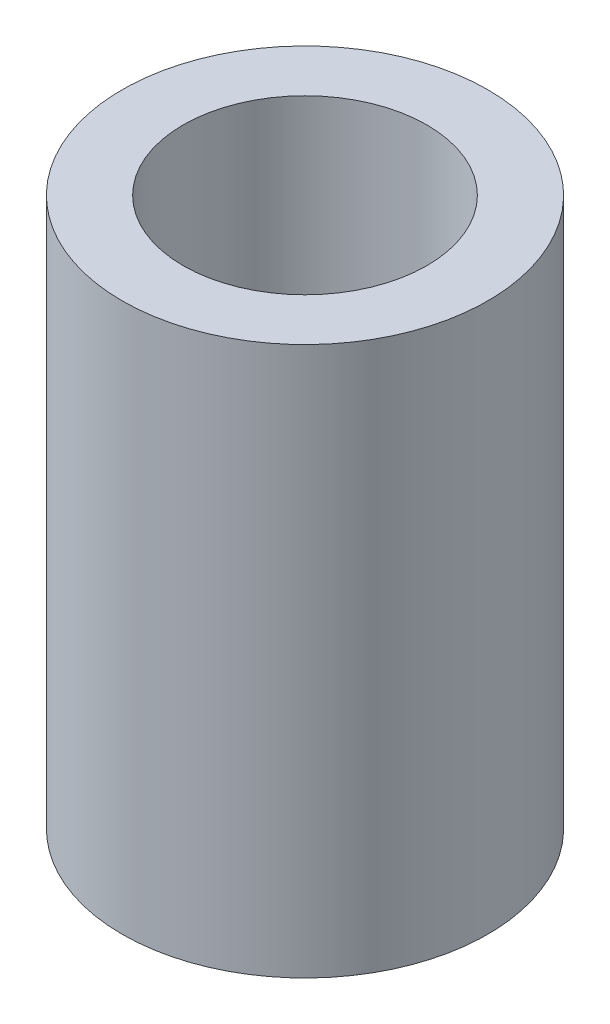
ISO-10303-21;
HEADER;
FILE_DESCRIPTION(('STEP AP214'),'2;1');
FILE_NAME('part.step','',(''),(''),'','','');
FILE_SCHEMA(('AUTOMOTIVE_DESIGN { 1 0 10303 214 1 1 1 1 }'));
ENDSEC;
DATA;
#1=APPLICATION_CONTEXT('core data for automotive mechanical design processes');
#2=APPLICATION_PROTOCOL_DEFINITION('international standard','automotive_design',2000,#1);
#3=PRODUCT_CONTEXT('',#1,'mechanical');
#4=PRODUCT('Part','Part','',(#3));
#5=PRODUCT_RELATED_PRODUCT_CATEGORY('part','',(#4));
#6=PRODUCT_DEFINITION_FORMATION('','',#4);
#7=PRODUCT_DEFINITION_CONTEXT('part definition',#1,'design');
#8=PRODUCT_DEFINITION('design','',#6,#7);
#9=PRODUCT_DEFINITION_SHAPE('','',#8);
#10=(LENGTH_UNIT() NAMED_UNIT(*) SI_UNIT(.MILLI.,.METRE.));
#11=(NAMED_UNIT(*) PLANE_ANGLE_UNIT() SI_UNIT($,.RADIAN.));
#12=(NAMED_UNIT(*) SI_UNIT($,.STERADIAN.) SOLID_ANGLE_UNIT());
#13=UNCERTAINTY_MEASURE_WITH_UNIT(LENGTH_MEASURE(1.E-05),#10,'distance_accuracy_value','');
#14=(GEOMETRIC_REPRESENTATION_CONTEXT(3) GLOBAL_UNCERTAINTY_ASSIGNED_CONTEXT((#13)) GLOBAL_UNIT_ASSIGNED_CONTEXT((#10,
#11,#12)) REPRESENTATION_CONTEXT('',''));
#15=CARTESIAN_POINT('',(0.,0.,0.));
#16=DIRECTION('',(0.,0.,1.));
#17=DIRECTION('',(1.,0.,0.));
#18=AXIS2_PLACEMENT_3D('',#15,#16,#17);
#19=CARTESIAN_POINT('',(0.,4.5,0.));
#20=DIRECTION('',(0.,1.,0.));
#21=DIRECTION('',(0.,0.,1.));
#22=AXIS2_PLACEMENT_3D('',#19,#20,#21);
#23=PLANE('',#22);
#24=CARTESIAN_POINT('',(0.,4.5,0.));
#25=DIRECTION('',(0.,1.,0.));
#26=DIRECTION('',(0.,0.,1.));
#27=AXIS2_PLACEMENT_3D('',#24,#25,#26);
#28=CIRCLE('',#27,1.5);
#29=CARTESIAN_POINT('',(0.,4.5,1.5));
#30=VERTEX_POINT('',#29);
#31=EDGE_CURVE('E10',#30,#30,#28,.T.);
#32=ORIENTED_EDGE('',*,*,#31,.T.);
#33=EDGE_LOOP('',(#32));
#34=FACE_BOUND('',#33,.T.);
#35=CARTESIAN_POINT('',(0.,4.5,0.));
#36=DIRECTION('',(0.,1.,0.));
#37=DIRECTION('',(0.,0.,1.));
#38=AXIS2_PLACEMENT_3D('',#35,#36,#37);
#39=CIRCLE('',#38,1.);
#40=CARTESIAN_POINT('',(0.,4.5,1.));
#41=VERTEX_POINT('',#40);
#42=EDGE_CURVE('E44',#41,#41,#39,.T.);
#43=ORIENTED_EDGE('',*,*,#42,.F.);
#44=EDGE_LOOP('',(#43));
#45=FACE_BOUND('',#44,.T.);
#46=ADVANCED_FACE('F33',(#34,#45),#23,.T.);
#47=CARTESIAN_POINT('',(0.,0.,0.));
#48=DIRECTION('',(0.,1.,0.));
#49=DIRECTION('',(0.,0.,1.));
#50=AXIS2_PLACEMENT_3D('',#47,#48,#49);
#51=PLANE('',#50);
#52=CARTESIAN_POINT('',(0.,0.,0.));
#53=DIRECTION('',(0.,1.,0.));
#54=DIRECTION('',(0.,0.,1.));
#55=AXIS2_PLACEMENT_3D('',#52,#53,#54);
#56=CIRCLE('',#55,1.5);
#57=CARTESIAN_POINT('',(0.,0.,1.5));
#58=VERTEX_POINT('',#57);
#59=EDGE_CURVE('E37',#58,#58,#56,.T.);
#60=ORIENTED_EDGE('',*,*,#59,.F.);
#61=EDGE_LOOP('',(#60));
#62=FACE_BOUND('',#61,.T.);
#63=CARTESIAN_POINT('',(0.,0.,0.));
#64=DIRECTION('',(0.,1.,0.));
#65=DIRECTION('',(0.,0.,1.));
#66=AXIS2_PLACEMENT_3D('',#63,#64,#65);
#67=CIRCLE('',#66,1.);
#68=CARTESIAN_POINT('',(0.,0.,1.));
#69=VERTEX_POINT('',#68);
#70=EDGE_CURVE('E46',#69,#69,#67,.T.);
#71=ORIENTED_EDGE('',*,*,#70,.T.);
#72=EDGE_LOOP('',(#71));
#73=FACE_BOUND('',#72,.T.);
#74=ADVANCED_FACE('F56',(#62,#73),#51,.F.);
#75=CARTESIAN_POINT('',(0.,4.5,0.));
#76=DIRECTION('',(0.,-1.,0.));
#77=DIRECTION('',(0.,0.,-1.));
#78=AXIS2_PLACEMENT_3D('',#75,#76,#77);
#79=CYLINDRICAL_SURFACE('',#78,1.5);
#80=ORIENTED_EDGE('',*,*,#31,.F.);
#81=EDGE_LOOP('',(#80));
#82=FACE_BOUND('',#81,.T.);
#83=ORIENTED_EDGE('',*,*,#59,.T.);
#84=EDGE_LOOP('',(#83));
#85=FACE_BOUND('',#84,.T.);
#86=ADVANCED_FACE('F35',(#82,#85),#79,.T.);
#87=CARTESIAN_POINT('',(0.,4.5,0.));
#88=DIRECTION('',(0.,-1.,0.));
#89=DIRECTION('',(0.,0.,-1.));
#90=AXIS2_PLACEMENT_3D('',#87,#88,#89);
#91=CYLINDRICAL_SURFACE('',#90,1.);
#92=ORIENTED_EDGE('',*,*,#42,.T.);
#93=EDGE_LOOP('',(#92));
#94=FACE_BOUND('',#93,.T.);
#95=ORIENTED_EDGE('',*,*,#70,.F.);
#96=EDGE_LOOP('',(#95));
#97=FACE_BOUND('',#96,.T.);
#98=ADVANCED_FACE('F52',(#94,#97),#91,.F.);
#99=CLOSED_SHELL('',(#46,#74,#86,#98));
#100=MANIFOLD_SOLID_BREP('B2',#99);
#101=ADVANCED_BREP_SHAPE_REPRESENTATION('',(#18,#100),#14);
#102=SHAPE_DEFINITION_REPRESENTATION(#9,#101);
ENDSEC;
END-ISO-10303-21;
